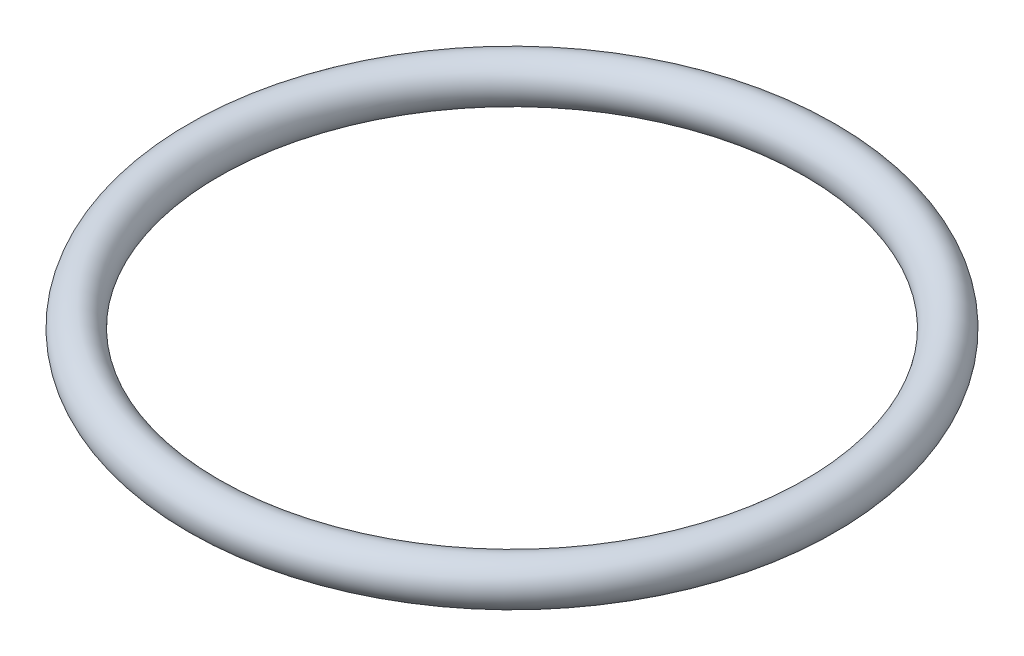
from build123d import *

# Parameters (mm, degrees)
SKETCH3_R = 0.889


with BuildPart() as part:
    # Sketch3 → Revolve1 (revolve)
    with BuildSketch(Plane(origin=(0, 0, 0), x_dir=(0, 0, -1), z_dir=(1, 0, 0)), mode=Mode.PRIVATE) as revolve1_sk:
        with Locations((-12.79525, 0.8382)):
            Circle(SKETCH3_R)
    revolve(revolve1_sk.sketch.rotate(Axis((0, 0, 0), (0, 1, 0)), 180), axis=Axis((0, 0, 0), (0, 1, 0)))


solid = part.part
